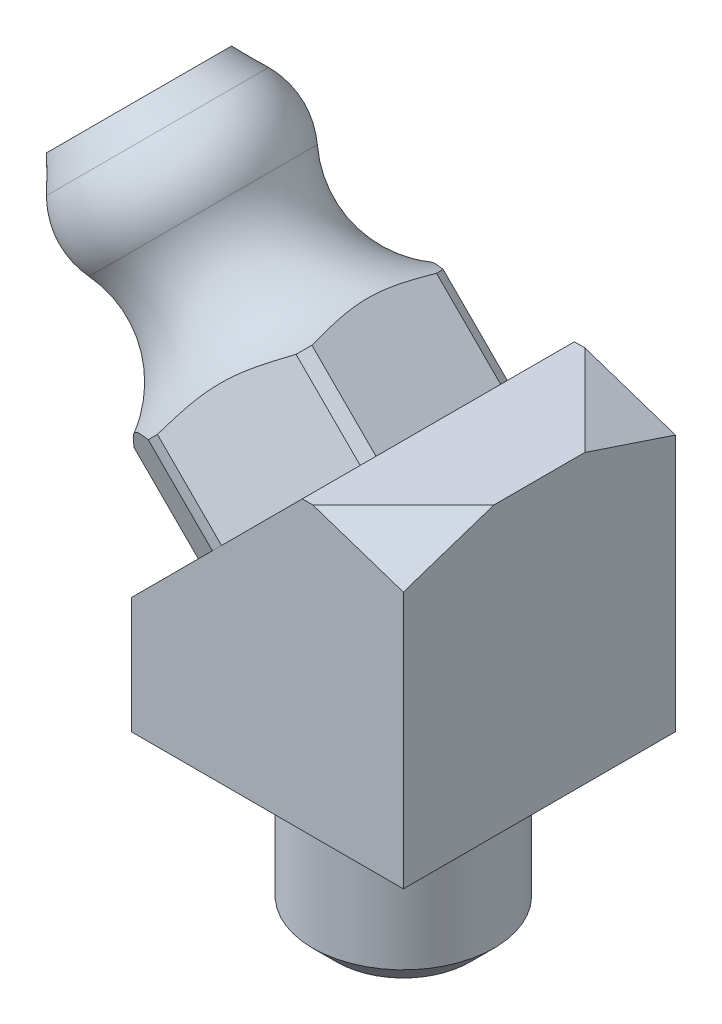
ISO-10303-21;
HEADER;
FILE_DESCRIPTION(('STEP AP214'),'2;1');
FILE_NAME('part.step','',(''),(''),'','','');
FILE_SCHEMA(('AUTOMOTIVE_DESIGN { 1 0 10303 214 1 1 1 1 }'));
ENDSEC;
DATA;
#1=APPLICATION_CONTEXT('core data for automotive mechanical design processes');
#2=APPLICATION_PROTOCOL_DEFINITION('international standard','automotive_design',2000,#1);
#3=PRODUCT_CONTEXT('',#1,'mechanical');
#4=PRODUCT('Part','Part','',(#3));
#5=PRODUCT_RELATED_PRODUCT_CATEGORY('part','',(#4));
#6=PRODUCT_DEFINITION_FORMATION('','',#4);
#7=PRODUCT_DEFINITION_CONTEXT('part definition',#1,'design');
#8=PRODUCT_DEFINITION('design','',#6,#7);
#9=PRODUCT_DEFINITION_SHAPE('','',#8);
#10=(LENGTH_UNIT() NAMED_UNIT(*) SI_UNIT(.MILLI.,.METRE.));
#11=(NAMED_UNIT(*) PLANE_ANGLE_UNIT() SI_UNIT($,.RADIAN.));
#12=(NAMED_UNIT(*) SI_UNIT($,.STERADIAN.) SOLID_ANGLE_UNIT());
#13=UNCERTAINTY_MEASURE_WITH_UNIT(LENGTH_MEASURE(1.E-05),#10,'distance_accuracy_value','');
#14=(GEOMETRIC_REPRESENTATION_CONTEXT(3) GLOBAL_UNCERTAINTY_ASSIGNED_CONTEXT((#13)) GLOBAL_UNIT_ASSIGNED_CONTEXT((#10,
#11,#12)) REPRESENTATION_CONTEXT('',''));
#15=CARTESIAN_POINT('',(0.,0.,0.));
#16=DIRECTION('',(0.,0.,1.));
#17=DIRECTION('',(1.,0.,0.));
#18=AXIS2_PLACEMENT_3D('',#15,#16,#17);
#19=CARTESIAN_POINT('',(-4.5,0.,4.5));
#20=DIRECTION('',(0.,0.,-1.));
#21=DIRECTION('',(-1.,0.,0.));
#22=AXIS2_PLACEMENT_3D('',#19,#20,#21);
#23=PLANE('',#22);
#24=DIRECTION('',(0.,-1.,0.));
#25=VECTOR('',#24,1.);
#26=CARTESIAN_POINT('',(4.5,9.5,4.5));
#27=LINE('',#26,#25);
#28=CARTESIAN_POINT('',(4.5,8.5,4.5));
#29=VERTEX_POINT('',#28);
#30=CARTESIAN_POINT('',(4.5,0.,4.5));
#31=VERTEX_POINT('',#30);
#32=EDGE_CURVE('E172',#29,#31,#27,.T.);
#33=ORIENTED_EDGE('',*,*,#32,.F.);
#34=DIRECTION('',(-0.948683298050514,0.316227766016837,0.));
#35=VECTOR('',#34,1.);
#36=CARTESIAN_POINT('',(-1.05000000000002,10.35,4.5));
#37=LINE('',#36,#35);
#38=CARTESIAN_POINT('',(1.49999999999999,9.5,4.5));
#39=VERTEX_POINT('',#38);
#40=EDGE_CURVE('E11',#29,#39,#37,.T.);
#41=ORIENTED_EDGE('',*,*,#40,.T.);
#42=DIRECTION('',(-1.,0.,0.));
#43=VECTOR('',#42,1.);
#44=CARTESIAN_POINT('',(4.5,9.5,4.5));
#45=LINE('',#44,#43);
#46=CARTESIAN_POINT('',(1.15685424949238,9.5,4.5));
#47=VERTEX_POINT('',#46);
#48=EDGE_CURVE('E178',#39,#47,#45,.T.);
#49=ORIENTED_EDGE('',*,*,#48,.T.);
#50=DIRECTION('',(0.707106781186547,0.707106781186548,0.));
#51=VECTOR('',#50,1.);
#52=CARTESIAN_POINT('',(-4.5,3.84314575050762,4.5));
#53=LINE('',#52,#51);
#54=CARTESIAN_POINT('',(-1.67157287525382,6.67157287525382,4.5));
#55=VERTEX_POINT('',#54);
#56=EDGE_CURVE('E240',#55,#47,#53,.T.);
#57=ORIENTED_EDGE('',*,*,#56,.F.);
#58=CARTESIAN_POINT('',(-4.5,3.84314575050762,4.5));
#59=VERTEX_POINT('',#58);
#60=EDGE_CURVE('E182',#59,#55,#53,.T.);
#61=ORIENTED_EDGE('',*,*,#60,.F.);
#62=DIRECTION('',(0.,1.,0.));
#63=VECTOR('',#62,1.);
#64=CARTESIAN_POINT('',(-4.5,0.,4.5));
#65=LINE('',#64,#63);
#66=CARTESIAN_POINT('',(-4.5,0.,4.5));
#67=VERTEX_POINT('',#66);
#68=EDGE_CURVE('E248',#67,#59,#65,.T.);
#69=ORIENTED_EDGE('',*,*,#68,.F.);
#70=DIRECTION('',(1.,0.,0.));
#71=VECTOR('',#70,1.);
#72=CARTESIAN_POINT('',(-4.5,0.,4.5));
#73=LINE('',#72,#71);
#74=EDGE_CURVE('E176',#67,#31,#73,.T.);
#75=ORIENTED_EDGE('',*,*,#74,.T.);
#76=EDGE_LOOP('',(#33,#41,#49,#57,#61,#69,#75));
#77=FACE_BOUND('',#76,.T.);
#78=ADVANCED_FACE('F30',(#77),#23,.F.);
#79=CARTESIAN_POINT('',(4.5,9.5,4.5));
#80=DIRECTION('',(0.,-1.,0.));
#81=DIRECTION('',(1.,0.,0.));
#82=AXIS2_PLACEMENT_3D('',#79,#80,#81);
#83=PLANE('',#82);
#84=ORIENTED_EDGE('',*,*,#48,.F.);
#85=DIRECTION('',(0.707106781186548,0.,-0.707106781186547));
#86=VECTOR('',#85,1.);
#87=CARTESIAN_POINT('',(3.,9.5,3.));
#88=LINE('',#87,#86);
#89=CARTESIAN_POINT('',(4.5,9.5,1.5));
#90=VERTEX_POINT('',#89);
#91=EDGE_CURVE('E45',#39,#90,#88,.T.);
#92=ORIENTED_EDGE('',*,*,#91,.T.);
#93=DIRECTION('',(0.,0.,-1.));
#94=VECTOR('',#93,1.);
#95=CARTESIAN_POINT('',(4.5,9.5,4.5));
#96=LINE('',#95,#94);
#97=CARTESIAN_POINT('',(4.5,9.5,-1.5));
#98=VERTEX_POINT('',#97);
#99=EDGE_CURVE('E51',#90,#98,#96,.T.);
#100=ORIENTED_EDGE('',*,*,#99,.T.);
#101=DIRECTION('',(-0.707106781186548,0.,-0.707106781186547));
#102=VECTOR('',#101,1.);
#103=CARTESIAN_POINT('',(7.5,9.5,1.5));
#104=LINE('',#103,#102);
#105=CARTESIAN_POINT('',(1.5,9.5,-4.5));
#106=VERTEX_POINT('',#105);
#107=EDGE_CURVE('E229',#98,#106,#104,.T.);
#108=ORIENTED_EDGE('',*,*,#107,.T.);
#109=DIRECTION('',(-1.,0.,0.));
#110=VECTOR('',#109,1.);
#111=CARTESIAN_POINT('',(4.5,9.5,-4.5));
#112=LINE('',#111,#110);
#113=CARTESIAN_POINT('',(1.15685424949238,9.5,-4.5));
#114=VERTEX_POINT('',#113);
#115=EDGE_CURVE('E257',#106,#114,#112,.T.);
#116=ORIENTED_EDGE('',*,*,#115,.T.);
#117=DIRECTION('',(0.,0.,-1.));
#118=VECTOR('',#117,1.);
#119=CARTESIAN_POINT('',(1.15685424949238,9.5,4.5));
#120=LINE('',#119,#118);
#121=CARTESIAN_POINT('',(1.15685424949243,9.50000000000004,-2.06155281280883));
#122=VERTEX_POINT('',#121);
#123=EDGE_CURVE('E195',#122,#114,#120,.T.);
#124=ORIENTED_EDGE('',*,*,#123,.F.);
#125=CARTESIAN_POINT('',(1.15685424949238,9.5,2.06155281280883));
#126=VERTEX_POINT('',#125);
#127=EDGE_CURVE('E194',#126,#122,#120,.T.);
#128=ORIENTED_EDGE('',*,*,#127,.F.);
#129=EDGE_CURVE('E192',#47,#126,#120,.T.);
#130=ORIENTED_EDGE('',*,*,#129,.F.);
#131=EDGE_LOOP('',(#84,#92,#100,#108,#116,#124,#128,#130));
#132=FACE_BOUND('',#131,.T.);
#133=ADVANCED_FACE('F234',(#132),#83,.F.);
#134=CARTESIAN_POINT('',(-5.70769747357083,10.7076974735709,0.));
#135=DIRECTION('',(-0.707106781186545,0.70710678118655,0.));
#136=DIRECTION('',(-0.70710678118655,-0.707106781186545,0.));
#137=AXIS2_PLACEMENT_3D('',#134,#135,#136);
#138=TOROIDAL_SURFACE('',#137,5.79114264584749,3.);
#139=CARTESIAN_POINT('',(-6.62132034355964,11.6213203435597,0.));
#140=DIRECTION('',(-0.707106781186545,0.70710678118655,0.));
#141=DIRECTION('',(-0.70710678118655,-0.707106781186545,0.));
#142=AXIS2_PLACEMENT_3D('',#139,#140,#141);
#143=CIRCLE('',#142,3.08363705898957);
#144=CARTESIAN_POINT('',(-8.80178101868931,9.44085966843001,0.));
#145=VERTEX_POINT('',#144);
#146=EDGE_CURVE('E271',#145,#145,#143,.T.);
#147=ORIENTED_EDGE('',*,*,#146,.F.);
#148=EDGE_LOOP('',(#147));
#149=FACE_BOUND('',#148,.T.);
#150=CARTESIAN_POINT('',(-3.79289321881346,8.79289321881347,0.));
#151=DIRECTION('',(-0.707106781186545,0.70710678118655,0.));
#152=DIRECTION('',(-0.70710678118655,-0.707106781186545,0.));
#153=AXIS2_PLACEMENT_3D('',#150,#151,#152);
#154=CIRCLE('',#153,4.5);
#155=CARTESIAN_POINT('',(-6.62132034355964,5.96446609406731,2.06155281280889));
#156=VERTEX_POINT('',#155);
#157=CARTESIAN_POINT('',(-6.46954489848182,6.11624153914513,2.43332520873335));
#158=VERTEX_POINT('',#157);
#159=EDGE_CURVE('E274',#156,#158,#154,.T.);
#160=ORIENTED_EDGE('',*,*,#159,.T.);
#161=CARTESIAN_POINT('',(-6.58366799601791,5.92632384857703,2.30920107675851));
#162=CARTESIAN_POINT('',(-6.52491432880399,6.02314401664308,2.37271382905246));
#163=CARTESIAN_POINT('',(-6.46696755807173,6.12051787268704,2.43612320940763));
#164=CARTESIAN_POINT('',(-6.35085272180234,6.31525555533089,2.56302821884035));
#165=CARTESIAN_POINT('',(-6.29268448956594,6.41261926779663,2.62652386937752));
#166=CARTESIAN_POINT('',(-6.17398746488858,6.60669802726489,2.75421404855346));
#167=CARTESIAN_POINT('',(-6.11344488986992,6.70340362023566,2.81841034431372));
#168=CARTESIAN_POINT('',(-5.98845520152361,6.8939495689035,2.94722722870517));
#169=CARTESIAN_POINT('',(-5.92400940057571,6.98779087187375,3.01184766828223));
#170=CARTESIAN_POINT('',(-5.79129113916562,7.16853006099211,3.13981613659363));
#171=CARTESIAN_POINT('',(-5.72317056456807,7.25554741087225,3.20315092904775));
#172=CARTESIAN_POINT('',(-5.5805613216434,7.42397161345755,3.33012980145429));
#173=CARTESIAN_POINT('',(-5.50607356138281,7.50537926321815,3.3937738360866));
#174=CARTESIAN_POINT('',(-5.35091159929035,7.66143445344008,3.52082770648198));
#175=CARTESIAN_POINT('',(-5.27026240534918,7.73610689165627,3.58423749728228));
#176=CARTESIAN_POINT('',(-5.103312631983,7.87909242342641,3.71076805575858));
#177=CARTESIAN_POINT('',(-5.01701135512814,7.94740472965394,3.77388878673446));
#178=CARTESIAN_POINT('',(-4.85057169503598,8.07086047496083,3.89223809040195));
#179=CARTESIAN_POINT('',(-4.77091027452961,8.12660613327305,3.94751779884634));
#180=CARTESIAN_POINT('',(-4.60915970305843,8.23500613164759,4.05780630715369));
#181=CARTESIAN_POINT('',(-4.52706765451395,8.28765653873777,4.11281468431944));
#182=CARTESIAN_POINT('',(-4.36040096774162,8.39168714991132,4.22332639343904));
#183=CARTESIAN_POINT('',(-4.2758077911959,8.44304076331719,4.27882643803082));
#184=CARTESIAN_POINT('',(-4.10625795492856,8.54485298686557,4.38960953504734));
#185=CARTESIAN_POINT('',(-4.0213024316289,8.59531325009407,4.44489279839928));
#186=CARTESIAN_POINT('',(-3.93650705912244,8.64599230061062,4.5002));
#187=B_SPLINE_CURVE_WITH_KNOTS('',3,(#161,#162,#163,#164,#165,#166,#167,#168,#169,#170,#171,
#172,#173,#174,#175,#176,#177,#178,#179,#180,#181,#182,#183,#184,#185,#186),.UNSPECIFIED.,.F.,
.F.,(4,2,2,2,2,2,2,2,2,2,2,2,4),(0.,0.389537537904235,0.779477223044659,1.17217402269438,
1.56473951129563,1.94662073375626,2.32844758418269,2.70879954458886,3.08919852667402,
3.42464287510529,3.76050463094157,4.10088145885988,4.44054347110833),.UNSPECIFIED.);
#188=CARTESIAN_POINT('',(-3.94466866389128,8.64111777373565,4.49487802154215));
#189=VERTEX_POINT('',#188);
#190=EDGE_CURVE('E284',#158,#189,#187,.T.);
#191=ORIENTED_EDGE('',*,*,#190,.T.);
#192=CARTESIAN_POINT('',(-3.64111777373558,8.94466866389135,4.49487802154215));
#193=VERTEX_POINT('',#192);
#194=EDGE_CURVE('E277',#189,#193,#154,.T.);
#195=ORIENTED_EDGE('',*,*,#194,.T.);
#196=CARTESIAN_POINT('',(-0.926323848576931,11.5836679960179,2.30920107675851));
#197=CARTESIAN_POINT('',(-1.02314401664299,11.524914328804,2.37271382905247));
#198=CARTESIAN_POINT('',(-1.12051787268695,11.4669675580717,2.43612320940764));
#199=CARTESIAN_POINT('',(-1.31525555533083,11.3508527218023,2.56302821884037));
#200=CARTESIAN_POINT('',(-1.41261926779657,11.2926844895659,2.62652386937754));
#201=CARTESIAN_POINT('',(-1.60669802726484,11.1739874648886,2.75421404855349));
#202=CARTESIAN_POINT('',(-1.70340362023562,11.1134448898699,2.81841034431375));
#203=CARTESIAN_POINT('',(-1.89394956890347,10.9884552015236,2.94722722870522));
#204=CARTESIAN_POINT('',(-1.98779087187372,10.9240094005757,3.01184766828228));
#205=CARTESIAN_POINT('',(-2.1685300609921,10.7912911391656,3.13981613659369));
#206=CARTESIAN_POINT('',(-2.25554741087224,10.723170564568,3.20315092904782));
#207=CARTESIAN_POINT('',(-2.42397161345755,10.5805613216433,3.33012980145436));
#208=CARTESIAN_POINT('',(-2.50537926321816,10.5060735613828,3.39377383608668));
#209=CARTESIAN_POINT('',(-2.66143445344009,10.3509115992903,3.52082770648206));
#210=CARTESIAN_POINT('',(-2.73610689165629,10.2702624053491,3.58423749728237));
#211=CARTESIAN_POINT('',(-2.87909242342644,10.1033126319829,3.71076805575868));
#212=CARTESIAN_POINT('',(-2.94740472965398,10.017011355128,3.77388878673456));
#213=CARTESIAN_POINT('',(-3.07086047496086,9.85057169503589,3.89223809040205));
#214=CARTESIAN_POINT('',(-3.12660613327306,9.77091027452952,3.94751779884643));
#215=CARTESIAN_POINT('',(-3.23500613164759,9.60915970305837,4.05780630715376));
#216=CARTESIAN_POINT('',(-3.28765653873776,9.52706765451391,4.11281468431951));
#217=CARTESIAN_POINT('',(-3.39168714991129,9.3604009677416,4.22332639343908));
#218=CARTESIAN_POINT('',(-3.44304076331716,9.27580779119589,4.27882643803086));
#219=CARTESIAN_POINT('',(-3.54485298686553,9.10625795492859,4.38960953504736));
#220=CARTESIAN_POINT('',(-3.59531325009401,9.02130243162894,4.44489279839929));
#221=CARTESIAN_POINT('',(-3.64599230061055,8.9365070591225,4.5002));
#222=B_SPLINE_CURVE_WITH_KNOTS('',3,(#196,#197,#198,#199,#200,#201,#202,#203,#204,#205,#206,
#207,#208,#209,#210,#211,#212,#213,#214,#215,#216,#217,#218,#219,#220,#221),.UNSPECIFIED.,.F.,
.F.,(4,2,2,2,2,2,2,2,2,2,2,2,4),(0.,0.389537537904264,0.779477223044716,1.17217402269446,
1.56473951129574,1.9466207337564,2.32844758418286,2.70879954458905,3.08919852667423,
3.42464287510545,3.76050463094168,4.10088145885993,4.44054347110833),.UNSPECIFIED.);
#223=CARTESIAN_POINT('',(-1.1162415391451,11.4695448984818,2.43332520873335));
#224=VERTEX_POINT('',#223);
#225=EDGE_CURVE('E292',#224,#193,#222,.T.);
#226=ORIENTED_EDGE('',*,*,#225,.F.);
#227=CARTESIAN_POINT('',(-0.964466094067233,11.6213203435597,2.06155281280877));
#228=VERTEX_POINT('',#227);
#229=EDGE_CURVE('E468',#224,#228,#154,.T.);
#230=ORIENTED_EDGE('',*,*,#229,.T.);
#231=CARTESIAN_POINT('',(-0.926598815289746,11.5834530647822,-2.30960107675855));
#232=CARTESIAN_POINT('',(-0.945621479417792,11.6024757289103,-2.18265112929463));
#233=CARTESIAN_POINT('',(-0.965323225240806,11.6221774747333,-2.05590756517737));
#234=CARTESIAN_POINT('',(-1.00461118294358,11.661465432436,-1.80224897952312));
#235=CARTESIAN_POINT('',(-1.02419725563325,11.6810515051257,-1.67533391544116));
#236=CARTESIAN_POINT('',(-1.06186574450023,11.7187199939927,-1.42012094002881));
#237=CARTESIAN_POINT('',(-1.07993673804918,11.7367909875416,-1.29181955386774));
#238=CARTESIAN_POINT('',(-1.11270108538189,11.7695553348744,-1.03436921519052));
#239=CARTESIAN_POINT('',(-1.12739554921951,11.784249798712,-0.905220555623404));
#240=CARTESIAN_POINT('',(-1.15142339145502,11.8082776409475,-0.649320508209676));
#241=CARTESIAN_POINT('',(-1.16088663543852,11.817740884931,-0.522594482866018));
#242=CARTESIAN_POINT('',(-1.17381979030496,11.8306740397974,-0.268523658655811));
#243=CARTESIAN_POINT('',(-1.17729060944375,11.8341448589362,-0.141178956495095));
#244=CARTESIAN_POINT('',(-1.17775286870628,11.8346071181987,0.113035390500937));
#245=CARTESIAN_POINT('',(-1.1747696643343,11.8316239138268,0.239904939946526));
#246=CARTESIAN_POINT('',(-1.16279313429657,11.819647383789,0.493068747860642));
#247=CARTESIAN_POINT('',(-1.15379889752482,11.8106531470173,0.619362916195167));
#248=CARTESIAN_POINT('',(-1.13050880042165,11.7873630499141,0.87589246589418));
#249=CARTESIAN_POINT('',(-1.11602163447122,11.7728758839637,1.00609172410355));
#250=CARTESIAN_POINT('',(-1.08347703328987,11.7403312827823,1.26578122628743));
#251=CARTESIAN_POINT('',(-1.06541377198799,11.7222680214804,1.39526995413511));
#252=CARTESIAN_POINT('',(-1.02719155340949,11.6840458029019,1.65573994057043));
#253=CARTESIAN_POINT('',(-1.00700406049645,11.6638583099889,1.78671256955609));
#254=CARTESIAN_POINT('',(-0.976627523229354,11.6334817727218,1.9829566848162));
#255=CARTESIAN_POINT('',(-0.966499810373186,11.6233540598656,2.0482479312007));
#256=CARTESIAN_POINT('',(-0.946391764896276,11.6032460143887,2.17887588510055));
#257=CARTESIAN_POINT('',(-0.936411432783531,11.593265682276,2.24421259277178));
#258=CARTESIAN_POINT('',(-0.926598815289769,11.5834530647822,2.30960107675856));
#259=B_SPLINE_CURVE_WITH_KNOTS('',3,(#231,#232,#233,#234,#235,#236,#237,#238,#239,#240,#241,
#242,#243,#244,#245,#246,#247,#248,#249,#250,#251,#252,#253,#254,#255,#256,#257,#258),
.UNSPECIFIED.,.F.,.F.,(4,2,2,2,2,2,2,2,2,2,2,2,2,4),(0.,0.389306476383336,0.779012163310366,
1.1714320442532,1.56372272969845,1.94577878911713,2.32777693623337,2.70827707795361,
3.08883490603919,3.48408755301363,3.8799895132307,4.28212932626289,4.48266064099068,
4.68319264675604),.UNSPECIFIED.);
#260=CARTESIAN_POINT('',(-0.964466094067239,11.6213203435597,-2.06155281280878));
#261=VERTEX_POINT('',#260);
#262=EDGE_CURVE('E420',#261,#228,#259,.T.);
#263=ORIENTED_EDGE('',*,*,#262,.F.);
#264=CARTESIAN_POINT('',(-1.11624153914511,11.4695448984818,-2.43332520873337));
#265=VERTEX_POINT('',#264);
#266=EDGE_CURVE('E469',#261,#265,#154,.T.);
#267=ORIENTED_EDGE('',*,*,#266,.T.);
#268=CARTESIAN_POINT('',(-0.926323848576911,11.5836679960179,-2.30920107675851));
#269=CARTESIAN_POINT('',(-1.02314401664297,11.524914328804,-2.37271382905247));
#270=CARTESIAN_POINT('',(-1.12051787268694,11.4669675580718,-2.43612320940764));
#271=CARTESIAN_POINT('',(-1.31525555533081,11.3508527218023,-2.56302821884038));
#272=CARTESIAN_POINT('',(-1.41261926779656,11.2926844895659,-2.62652386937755));
#273=CARTESIAN_POINT('',(-1.60669802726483,11.1739874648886,-2.7542140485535));
#274=CARTESIAN_POINT('',(-1.70340362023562,11.1134448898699,-2.81841034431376));
#275=CARTESIAN_POINT('',(-1.89394956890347,10.9884552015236,-2.94722722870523));
#276=CARTESIAN_POINT('',(-1.98779087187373,10.9240094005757,-3.01184766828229));
#277=CARTESIAN_POINT('',(-2.16853006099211,10.7912911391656,-3.13981613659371));
#278=CARTESIAN_POINT('',(-2.25554741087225,10.723170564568,-3.20315092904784));
#279=CARTESIAN_POINT('',(-2.42397161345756,10.5805613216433,-3.33012980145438));
#280=CARTESIAN_POINT('',(-2.50537926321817,10.5060735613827,-3.3937738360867));
#281=CARTESIAN_POINT('',(-2.66143445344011,10.3509115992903,-3.52082770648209));
#282=CARTESIAN_POINT('',(-2.73610689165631,10.2702624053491,-3.5842374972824));
#283=CARTESIAN_POINT('',(-2.87909242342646,10.1033126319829,-3.71076805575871));
#284=CARTESIAN_POINT('',(-2.947404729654,10.017011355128,-3.7738887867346));
#285=CARTESIAN_POINT('',(-3.07086047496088,9.85057169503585,-3.89223809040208));
#286=CARTESIAN_POINT('',(-3.12660613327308,9.77091027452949,-3.94751779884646));
#287=CARTESIAN_POINT('',(-3.23500613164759,9.60915970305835,-4.05780630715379));
#288=CARTESIAN_POINT('',(-3.28765653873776,9.52706765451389,-4.11281468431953));
#289=CARTESIAN_POINT('',(-3.39168714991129,9.36040096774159,-4.2233263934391));
#290=CARTESIAN_POINT('',(-3.44304076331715,9.27580779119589,-4.27882643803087));
#291=CARTESIAN_POINT('',(-3.54485298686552,9.10625795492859,-4.38960953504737));
#292=CARTESIAN_POINT('',(-3.595313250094,9.02130243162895,-4.44489279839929));
#293=CARTESIAN_POINT('',(-3.64599230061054,8.93650705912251,-4.5002));
#294=B_SPLINE_CURVE_WITH_KNOTS('',3,(#268,#269,#270,#271,#272,#273,#274,#275,#276,#277,#278,
#279,#280,#281,#282,#283,#284,#285,#286,#287,#288,#289,#290,#291,#292,#293),.UNSPECIFIED.,.F.,
.F.,(4,2,2,2,2,2,2,2,2,2,2,2,4),(0.,0.389537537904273,0.779477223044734,1.17217402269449,
1.56473951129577,1.94662073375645,2.32844758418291,2.70879954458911,3.08919852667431,
3.42464287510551,3.76050463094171,4.10088145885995,4.44054347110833),.UNSPECIFIED.);
#295=CARTESIAN_POINT('',(-3.64111777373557,8.94466866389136,-4.49487802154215));
#296=VERTEX_POINT('',#295);
#297=EDGE_CURVE('E441',#265,#296,#294,.T.);
#298=ORIENTED_EDGE('',*,*,#297,.T.);
#299=CARTESIAN_POINT('',(-3.94466866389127,8.64111777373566,-4.49487802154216));
#300=VERTEX_POINT('',#299);
#301=EDGE_CURVE('E470',#296,#300,#154,.T.);
#302=ORIENTED_EDGE('',*,*,#301,.T.);
#303=CARTESIAN_POINT('',(-6.58366799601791,5.92632384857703,-2.30920107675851));
#304=CARTESIAN_POINT('',(-6.52491432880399,6.02314401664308,-2.37271382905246));
#305=CARTESIAN_POINT('',(-6.46696755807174,6.12051787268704,-2.43612320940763));
#306=CARTESIAN_POINT('',(-6.35085272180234,6.3152555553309,-2.56302821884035));
#307=CARTESIAN_POINT('',(-6.29268448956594,6.41261926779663,-2.62652386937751));
#308=CARTESIAN_POINT('',(-6.17398746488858,6.60669802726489,-2.75421404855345));
#309=CARTESIAN_POINT('',(-6.11344488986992,6.70340362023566,-2.81841034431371));
#310=CARTESIAN_POINT('',(-5.98845520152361,6.8939495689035,-2.94722722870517));
#311=CARTESIAN_POINT('',(-5.92400940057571,6.98779087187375,-3.01184766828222));
#312=CARTESIAN_POINT('',(-5.79129113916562,7.16853006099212,-3.13981613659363));
#313=CARTESIAN_POINT('',(-5.72317056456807,7.25554741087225,-3.20315092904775));
#314=CARTESIAN_POINT('',(-5.5805613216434,7.42397161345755,-3.33012980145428));
#315=CARTESIAN_POINT('',(-5.50607356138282,7.50537926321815,-3.39377383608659));
#316=CARTESIAN_POINT('',(-5.35091159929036,7.66143445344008,-3.52082770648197));
#317=CARTESIAN_POINT('',(-5.27026240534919,7.73610689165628,-3.58423749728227));
#318=CARTESIAN_POINT('',(-5.103312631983,7.87909242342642,-3.71076805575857));
#319=CARTESIAN_POINT('',(-5.01701135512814,7.94740472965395,-3.77388878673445));
#320=CARTESIAN_POINT('',(-4.85057169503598,8.07086047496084,-3.89223809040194));
#321=CARTESIAN_POINT('',(-4.77091027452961,8.12660613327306,-3.94751779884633));
#322=CARTESIAN_POINT('',(-4.60915970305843,8.2350061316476,-4.05780630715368));
#323=CARTESIAN_POINT('',(-4.52706765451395,8.28765653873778,-4.11281468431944));
#324=CARTESIAN_POINT('',(-4.36040096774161,8.39168714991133,-4.22332639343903));
#325=CARTESIAN_POINT('',(-4.27580779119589,8.4430407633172,-4.27882643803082));
#326=CARTESIAN_POINT('',(-4.10625795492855,8.54485298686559,-4.38960953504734));
#327=CARTESIAN_POINT('',(-4.02130243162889,8.59531325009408,-4.44489279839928));
#328=CARTESIAN_POINT('',(-3.93650705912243,8.64599230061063,-4.5002));
#329=B_SPLINE_CURVE_WITH_KNOTS('',3,(#303,#304,#305,#306,#307,#308,#309,#310,#311,#312,#313,
#314,#315,#316,#317,#318,#319,#320,#321,#322,#323,#324,#325,#326,#327,#328),.UNSPECIFIED.,.F.,
.F.,(4,2,2,2,2,2,2,2,2,2,2,2,4),(0.,0.389537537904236,0.77947722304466,1.17217402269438,
1.56473951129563,1.94662073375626,2.32844758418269,2.70879954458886,3.08919852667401,
3.42464287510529,3.76050463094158,4.10088145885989,4.44054347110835),.UNSPECIFIED.);
#330=CARTESIAN_POINT('',(-6.46954489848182,6.11624153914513,-2.43332520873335));
#331=VERTEX_POINT('',#330);
#332=EDGE_CURVE('E447',#331,#300,#329,.T.);
#333=ORIENTED_EDGE('',*,*,#332,.F.);
#334=CARTESIAN_POINT('',(-6.62132034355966,5.96446609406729,-2.06155281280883));
#335=VERTEX_POINT('',#334);
#336=EDGE_CURVE('E278',#331,#335,#154,.T.);
#337=ORIENTED_EDGE('',*,*,#336,.T.);
#338=CARTESIAN_POINT('',(-6.58345306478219,5.92659881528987,-2.30960107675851));
#339=CARTESIAN_POINT('',(-6.60247572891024,5.94562147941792,-2.1826511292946));
#340=CARTESIAN_POINT('',(-6.62217747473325,5.96532322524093,-2.05590756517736));
#341=CARTESIAN_POINT('',(-6.66146543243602,6.0046111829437,-1.80224897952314));
#342=CARTESIAN_POINT('',(-6.68105150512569,6.02419725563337,-1.6753339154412));
#343=CARTESIAN_POINT('',(-6.71871999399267,6.06186574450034,-1.42012094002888));
#344=CARTESIAN_POINT('',(-6.73679098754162,6.0799367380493,-1.29181955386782));
#345=CARTESIAN_POINT('',(-6.76955533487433,6.112701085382,-1.03436921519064));
#346=CARTESIAN_POINT('',(-6.78424979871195,6.12739554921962,-0.905220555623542));
#347=CARTESIAN_POINT('',(-6.80827764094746,6.15142339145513,-0.649320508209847));
#348=CARTESIAN_POINT('',(-6.81774088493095,6.16088663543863,-0.522594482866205));
#349=CARTESIAN_POINT('',(-6.8306740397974,6.17381979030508,-0.268523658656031));
#350=CARTESIAN_POINT('',(-6.83414485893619,6.17729060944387,-0.141178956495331));
#351=CARTESIAN_POINT('',(-6.83460711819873,6.17775286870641,0.113035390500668));
#352=CARTESIAN_POINT('',(-6.83162391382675,6.17476966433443,0.239904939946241));
#353=CARTESIAN_POINT('',(-6.81964738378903,6.16279313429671,0.493068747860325));
#354=CARTESIAN_POINT('',(-6.81065314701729,6.15379889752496,0.619362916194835));
#355=CARTESIAN_POINT('',(-6.78736304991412,6.13050880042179,0.875892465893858));
#356=CARTESIAN_POINT('',(-6.77287588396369,6.11602163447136,1.00609172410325));
#357=CARTESIAN_POINT('',(-6.74033128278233,6.08347703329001,1.26578122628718));
#358=CARTESIAN_POINT('',(-6.72226802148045,6.06541377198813,1.39526995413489));
#359=CARTESIAN_POINT('',(-6.68404580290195,6.02719155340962,1.65573994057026));
#360=CARTESIAN_POINT('',(-6.6638583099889,6.00700406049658,1.78671256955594));
#361=CARTESIAN_POINT('',(-6.63348177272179,5.97662752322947,1.9829566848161));
#362=CARTESIAN_POINT('',(-6.62335405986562,5.9664998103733,2.04824793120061));
#363=CARTESIAN_POINT('',(-6.60324601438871,5.94639176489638,2.17887588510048));
#364=CARTESIAN_POINT('',(-6.59326568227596,5.93641143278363,2.24421259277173));
#365=CARTESIAN_POINT('',(-6.58345306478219,5.92659881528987,2.30960107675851));
#366=B_SPLINE_CURVE_WITH_KNOTS('',3,(#338,#339,#340,#341,#342,#343,#344,#345,#346,#347,#348,
#349,#350,#351,#352,#353,#354,#355,#356,#357,#358,#359,#360,#361,#362,#363,#364,#365),
.UNSPECIFIED.,.F.,.F.,(4,2,2,2,2,2,2,2,2,2,2,2,2,4),(0.,0.389306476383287,0.779012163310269,
1.17143204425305,1.56372272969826,1.94577878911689,2.32777693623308,2.70827707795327,
3.0888349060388,3.48408755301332,3.87998951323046,4.28212932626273,4.48266064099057,
4.68319264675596),.UNSPECIFIED.);
#367=EDGE_CURVE('E451',#335,#156,#366,.T.);
#368=ORIENTED_EDGE('',*,*,#367,.T.);
#369=EDGE_LOOP('',(#160,#191,#195,#226,#230,#263,#267,#298,#302,#333,#337,#368));
#370=FACE_BOUND('',#369,.T.);
#371=ADVANCED_FACE('F298',(#149,#370),#138,.F.);
#372=CARTESIAN_POINT('',(-9.77263204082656,14.7726320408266,0.));
#373=DIRECTION('',(-0.707106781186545,0.70710678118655,0.));
#374=DIRECTION('',(-0.70710678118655,-0.707106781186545,0.));
#375=AXIS2_PLACEMENT_3D('',#372,#373,#374);
#376=CYLINDRICAL_SURFACE('',#375,4.5);
#377=ORIENTED_EDGE('',*,*,#194,.F.);
#378=DIRECTION('',(-0.707106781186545,0.70710678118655,0.));
#379=VECTOR('',#378,1.);
#380=CARTESIAN_POINT('',(-9.92440748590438,14.6208565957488,4.49487802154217));
#381=LINE('',#380,#379);
#382=CARTESIAN_POINT('',(-1.82334832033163,6.51979743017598,4.49487802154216));
#383=VERTEX_POINT('',#382);
#384=EDGE_CURVE('E223',#189,#383,#381,.F.);
#385=ORIENTED_EDGE('',*,*,#384,.T.);
#386=CARTESIAN_POINT('',(-1.67157287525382,6.67157287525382,0.));
#387=DIRECTION('',(-0.707106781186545,0.70710678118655,0.));
#388=DIRECTION('',(-0.70710678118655,-0.707106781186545,0.));
#389=AXIS2_PLACEMENT_3D('',#386,#387,#388);
#390=CIRCLE('',#389,4.5);
#391=EDGE_CURVE('E282',#383,#55,#390,.T.);
#392=ORIENTED_EDGE('',*,*,#391,.T.);
#393=CARTESIAN_POINT('',(-1.51979743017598,6.82334832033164,4.49487802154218));
#394=VERTEX_POINT('',#393);
#395=EDGE_CURVE('E203',#55,#394,#390,.T.);
#396=ORIENTED_EDGE('',*,*,#395,.T.);
#397=DIRECTION('',(-0.707106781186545,0.70710678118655,0.));
#398=VECTOR('',#397,1.);
#399=CARTESIAN_POINT('',(-9.62085659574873,14.9244074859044,4.49487802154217));
#400=LINE('',#399,#398);
#401=EDGE_CURVE('E218',#193,#394,#400,.F.);
#402=ORIENTED_EDGE('',*,*,#401,.F.);
#403=EDGE_LOOP('',(#377,#385,#392,#396,#402));
#404=FACE_BOUND('',#403,.T.);
#405=ADVANCED_FACE('F312',(#404),#376,.T.);
#406=CARTESIAN_POINT('',(-4.49999999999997,3.84314575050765,2.06155281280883));
#407=VERTEX_POINT('',#406);
#408=CARTESIAN_POINT('',(-4.34822455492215,3.99492119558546,2.43332520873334));
#409=VERTEX_POINT('',#408);
#410=EDGE_CURVE('E279',#407,#409,#390,.T.);
#411=ORIENTED_EDGE('',*,*,#410,.T.);
#412=DIRECTION('',(-0.707106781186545,0.70710678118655,0.));
#413=VECTOR('',#412,1.);
#414=CARTESIAN_POINT('',(-12.4492837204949,12.0959803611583,2.43332520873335));
#415=LINE('',#414,#413);
#416=EDGE_CURVE('E220',#409,#158,#415,.T.);
#417=ORIENTED_EDGE('',*,*,#416,.T.);
#418=ORIENTED_EDGE('',*,*,#159,.F.);
#419=DIRECTION('',(-0.707106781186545,0.70710678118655,0.));
#420=VECTOR('',#419,1.);
#421=CARTESIAN_POINT('',(-12.6010591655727,11.9442049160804,2.06155281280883));
#422=LINE('',#421,#420);
#423=EDGE_CURVE('E202',#156,#407,#422,.F.);
#424=ORIENTED_EDGE('',*,*,#423,.T.);
#425=EDGE_LOOP('',(#411,#417,#418,#424));
#426=FACE_BOUND('',#425,.T.);
#427=ADVANCED_FACE('F314',(#426),#376,.T.);
#428=DIRECTION('',(-0.707106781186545,0.70710678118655,0.));
#429=VECTOR('',#428,1.);
#430=CARTESIAN_POINT('',(-7.0959803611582,17.449283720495,2.43332520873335));
#431=LINE('',#430,#429);
#432=CARTESIAN_POINT('',(1.00507880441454,9.34822455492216,2.43332520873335));
#433=VERTEX_POINT('',#432);
#434=EDGE_CURVE('E216',#433,#224,#431,.T.);
#435=ORIENTED_EDGE('',*,*,#434,.F.);
#436=EDGE_CURVE('E383',#433,#126,#390,.T.);
#437=ORIENTED_EDGE('',*,*,#436,.T.);
#438=DIRECTION('',(-0.707106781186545,0.70710678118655,0.));
#439=VECTOR('',#438,1.);
#440=CARTESIAN_POINT('',(-6.94420491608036,17.6010591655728,2.06155281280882));
#441=LINE('',#440,#439);
#442=EDGE_CURVE('E426',#228,#126,#441,.F.);
#443=ORIENTED_EDGE('',*,*,#442,.F.);
#444=ORIENTED_EDGE('',*,*,#229,.F.);
#445=EDGE_LOOP('',(#435,#437,#443,#444));
#446=FACE_BOUND('',#445,.T.);
#447=ADVANCED_FACE('F321',(#446),#376,.T.);
#448=ORIENTED_EDGE('',*,*,#301,.F.);
#449=DIRECTION('',(-0.707106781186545,0.70710678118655,0.));
#450=VECTOR('',#449,1.);
#451=CARTESIAN_POINT('',(-9.62085659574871,14.9244074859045,-4.49487802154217));
#452=LINE('',#451,#450);
#453=CARTESIAN_POINT('',(-1.51979743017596,6.82334832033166,-4.49487802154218));
#454=VERTEX_POINT('',#453);
#455=EDGE_CURVE('E213',#296,#454,#452,.F.);
#456=ORIENTED_EDGE('',*,*,#455,.T.);
#457=CARTESIAN_POINT('',(-1.67157287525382,6.67157287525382,-4.5));
#458=VERTEX_POINT('',#457);
#459=EDGE_CURVE('E373',#454,#458,#390,.T.);
#460=ORIENTED_EDGE('',*,*,#459,.T.);
#461=CARTESIAN_POINT('',(-1.82334832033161,6.519797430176,-4.49487802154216));
#462=VERTEX_POINT('',#461);
#463=EDGE_CURVE('E283',#458,#462,#390,.T.);
#464=ORIENTED_EDGE('',*,*,#463,.T.);
#465=DIRECTION('',(-0.707106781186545,0.70710678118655,0.));
#466=VECTOR('',#465,1.);
#467=CARTESIAN_POINT('',(-9.92440748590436,14.6208565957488,-4.49487802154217));
#468=LINE('',#467,#466);
#469=EDGE_CURVE('E208',#300,#462,#468,.F.);
#470=ORIENTED_EDGE('',*,*,#469,.F.);
#471=EDGE_LOOP('',(#448,#456,#460,#464,#470));
#472=FACE_BOUND('',#471,.T.);
#473=ADVANCED_FACE('F406',(#472),#376,.T.);
#474=DIRECTION('',(-0.707106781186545,0.70710678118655,0.));
#475=VECTOR('',#474,1.);
#476=CARTESIAN_POINT('',(-6.94420491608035,17.6010591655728,-2.06155281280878));
#477=LINE('',#476,#475);
#478=EDGE_CURVE('E382',#122,#261,#477,.T.);
#479=ORIENTED_EDGE('',*,*,#478,.F.);
#480=CARTESIAN_POINT('',(1.00507880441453,9.34822455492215,-2.43332520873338));
#481=VERTEX_POINT('',#480);
#482=EDGE_CURVE('E369',#122,#481,#390,.T.);
#483=ORIENTED_EDGE('',*,*,#482,.T.);
#484=DIRECTION('',(-0.707106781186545,0.70710678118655,0.));
#485=VECTOR('',#484,1.);
#486=CARTESIAN_POINT('',(-7.09598036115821,17.4492837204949,-2.43332520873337));
#487=LINE('',#486,#485);
#488=EDGE_CURVE('E210',#481,#265,#487,.T.);
#489=ORIENTED_EDGE('',*,*,#488,.T.);
#490=ORIENTED_EDGE('',*,*,#266,.F.);
#491=EDGE_LOOP('',(#479,#483,#489,#490));
#492=FACE_BOUND('',#491,.T.);
#493=ADVANCED_FACE('F327',(#492),#376,.T.);
#494=DIRECTION('',(-0.707106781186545,0.70710678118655,0.));
#495=VECTOR('',#494,1.);
#496=CARTESIAN_POINT('',(-12.4492837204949,12.0959803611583,-2.43332520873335));
#497=LINE('',#496,#495);
#498=CARTESIAN_POINT('',(-4.34822455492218,3.99492119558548,-2.43332520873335));
#499=VERTEX_POINT('',#498);
#500=EDGE_CURVE('E206',#499,#331,#497,.T.);
#501=ORIENTED_EDGE('',*,*,#500,.F.);
#502=CARTESIAN_POINT('',(-4.49999999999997,3.84314575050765,-2.06155281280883));
#503=VERTEX_POINT('',#502);
#504=EDGE_CURVE('E188',#499,#503,#390,.T.);
#505=ORIENTED_EDGE('',*,*,#504,.T.);
#506=DIRECTION('',(-0.707106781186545,0.70710678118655,0.));
#507=VECTOR('',#506,1.);
#508=CARTESIAN_POINT('',(-12.6010591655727,11.9442049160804,-2.06155281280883));
#509=LINE('',#508,#507);
#510=EDGE_CURVE('E199',#503,#335,#509,.T.);
#511=ORIENTED_EDGE('',*,*,#510,.T.);
#512=ORIENTED_EDGE('',*,*,#336,.F.);
#513=EDGE_LOOP('',(#501,#505,#511,#512));
#514=FACE_BOUND('',#513,.T.);
#515=ADVANCED_FACE('F316',(#514),#376,.T.);
#516=CARTESIAN_POINT('',(-4.5,3.84314575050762,4.5));
#517=DIRECTION('',(-0.707106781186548,0.707106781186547,0.));
#518=DIRECTION('',(-0.707106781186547,-0.707106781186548,0.));
#519=AXIS2_PLACEMENT_3D('',#516,#517,#518);
#520=PLANE('',#519);
#521=DIRECTION('',(-0.612372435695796,-0.612372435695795,-0.499999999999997));
#522=VECTOR('',#521,1.);
#523=CARTESIAN_POINT('',(-1.67157287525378,6.67157287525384,4.618802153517));
#524=LINE('',#523,#522);
#525=EDGE_CURVE('E391',#383,#409,#524,.T.);
#526=ORIENTED_EDGE('',*,*,#525,.T.);
#527=ORIENTED_EDGE('',*,*,#410,.F.);
#528=DIRECTION('',(0.,0.,-1.));
#529=VECTOR('',#528,1.);
#530=CARTESIAN_POINT('',(-4.5,3.84314575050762,4.5));
#531=LINE('',#530,#529);
#532=EDGE_CURVE('E196',#59,#407,#531,.T.);
#533=ORIENTED_EDGE('',*,*,#532,.F.);
#534=ORIENTED_EDGE('',*,*,#60,.T.);
#535=ORIENTED_EDGE('',*,*,#391,.F.);
#536=EDGE_LOOP('',(#526,#527,#533,#534,#535));
#537=FACE_BOUND('',#536,.T.);
#538=ADVANCED_FACE('F326',(#537),#520,.T.);
#539=ORIENTED_EDGE('',*,*,#56,.T.);
#540=ORIENTED_EDGE('',*,*,#129,.T.);
#541=ORIENTED_EDGE('',*,*,#436,.F.);
#542=DIRECTION('',(0.612372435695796,0.612372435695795,-0.499999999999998));
#543=VECTOR('',#542,1.);
#544=CARTESIAN_POINT('',(-1.67157287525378,6.67157287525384,4.618802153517));
#545=LINE('',#544,#543);
#546=EDGE_CURVE('E375',#394,#433,#545,.T.);
#547=ORIENTED_EDGE('',*,*,#546,.F.);
#548=ORIENTED_EDGE('',*,*,#395,.F.);
#549=EDGE_LOOP('',(#539,#540,#541,#547,#548));
#550=FACE_BOUND('',#549,.T.);
#551=ADVANCED_FACE('F243',(#550),#520,.T.);
#552=DIRECTION('',(0.612372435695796,0.612372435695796,0.499999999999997));
#553=VECTOR('',#552,1.);
#554=CARTESIAN_POINT('',(-1.67157287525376,6.67157287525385,-4.618802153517));
#555=LINE('',#554,#553);
#556=EDGE_CURVE('E366',#454,#481,#555,.T.);
#557=ORIENTED_EDGE('',*,*,#556,.T.);
#558=ORIENTED_EDGE('',*,*,#482,.F.);
#559=ORIENTED_EDGE('',*,*,#123,.T.);
#560=DIRECTION('',(0.707106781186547,0.707106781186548,0.));
#561=VECTOR('',#560,1.);
#562=CARTESIAN_POINT('',(-4.5,3.84314575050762,-4.5));
#563=LINE('',#562,#561);
#564=EDGE_CURVE('E261',#458,#114,#563,.T.);
#565=ORIENTED_EDGE('',*,*,#564,.F.);
#566=ORIENTED_EDGE('',*,*,#459,.F.);
#567=EDGE_LOOP('',(#557,#558,#559,#565,#566));
#568=FACE_BOUND('',#567,.T.);
#569=ADVANCED_FACE('F347',(#568),#520,.T.);
#570=CARTESIAN_POINT('',(-4.5,0.,4.5));
#571=DIRECTION('',(-1.,0.,0.));
#572=DIRECTION('',(0.,0.,1.));
#573=AXIS2_PLACEMENT_3D('',#570,#571,#572);
#574=PLANE('',#573);
#575=DIRECTION('',(0.,1.,0.));
#576=VECTOR('',#575,1.);
#577=CARTESIAN_POINT('',(-4.5,0.,-4.5));
#578=LINE('',#577,#576);
#579=CARTESIAN_POINT('',(-4.5,0.,-4.5));
#580=VERTEX_POINT('',#579);
#581=CARTESIAN_POINT('',(-4.5,3.84314575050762,-4.5));
#582=VERTEX_POINT('',#581);
#583=EDGE_CURVE('E262',#580,#582,#578,.T.);
#584=ORIENTED_EDGE('',*,*,#583,.F.);
#585=DIRECTION('',(0.,0.,-1.));
#586=VECTOR('',#585,1.);
#587=CARTESIAN_POINT('',(-4.5,0.,4.5));
#588=LINE('',#587,#586);
#589=EDGE_CURVE('E186',#67,#580,#588,.T.);
#590=ORIENTED_EDGE('',*,*,#589,.F.);
#591=ORIENTED_EDGE('',*,*,#68,.T.);
#592=ORIENTED_EDGE('',*,*,#532,.T.);
#593=EDGE_CURVE('E198',#407,#503,#531,.T.);
#594=ORIENTED_EDGE('',*,*,#593,.T.);
#595=EDGE_CURVE('E180',#503,#582,#531,.T.);
#596=ORIENTED_EDGE('',*,*,#595,.T.);
#597=EDGE_LOOP('',(#584,#590,#591,#592,#594,#596));
#598=FACE_BOUND('',#597,.T.);
#599=ADVANCED_FACE('F32',(#598),#574,.T.);
#600=CARTESIAN_POINT('',(-4.5,0.,4.5));
#601=DIRECTION('',(0.,1.,0.));
#602=DIRECTION('',(-1.,0.,0.));
#603=AXIS2_PLACEMENT_3D('',#600,#601,#602);
#604=PLANE('',#603);
#605=CARTESIAN_POINT('',(0.,0.,0.));
#606=DIRECTION('',(0.,1.,0.));
#607=DIRECTION('',(0.,0.,1.));
#608=AXIS2_PLACEMENT_3D('',#605,#606,#607);
#609=CIRCLE('',#608,3.);
#610=CARTESIAN_POINT('',(0.,0.,3.));
#611=VERTEX_POINT('',#610);
#612=EDGE_CURVE('E414',#611,#611,#609,.T.);
#613=ORIENTED_EDGE('',*,*,#612,.T.);
#614=EDGE_LOOP('',(#613));
#615=FACE_BOUND('',#614,.T.);
#616=DIRECTION('',(1.,0.,0.));
#617=VECTOR('',#616,1.);
#618=CARTESIAN_POINT('',(-4.5,0.,-4.5));
#619=LINE('',#618,#617);
#620=CARTESIAN_POINT('',(4.5,0.,-4.5));
#621=VERTEX_POINT('',#620);
#622=EDGE_CURVE('E250',#580,#621,#619,.T.);
#623=ORIENTED_EDGE('',*,*,#622,.T.);
#624=DIRECTION('',(0.,0.,-1.));
#625=VECTOR('',#624,1.);
#626=CARTESIAN_POINT('',(4.5,0.,4.5));
#627=LINE('',#626,#625);
#628=EDGE_CURVE('E189',#31,#621,#627,.T.);
#629=ORIENTED_EDGE('',*,*,#628,.F.);
#630=ORIENTED_EDGE('',*,*,#74,.F.);
#631=ORIENTED_EDGE('',*,*,#589,.T.);
#632=EDGE_LOOP('',(#623,#629,#630,#631));
#633=FACE_BOUND('',#632,.T.);
#634=ADVANCED_FACE('F339',(#615,#633),#604,.F.);
#635=CARTESIAN_POINT('',(4.5,9.5,4.5));
#636=DIRECTION('',(1.,0.,0.));
#637=DIRECTION('',(0.,1.,0.));
#638=AXIS2_PLACEMENT_3D('',#635,#636,#637);
#639=PLANE('',#638);
#640=DIRECTION('',(0.,0.316227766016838,-0.948683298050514));
#641=VECTOR('',#640,1.);
#642=CARTESIAN_POINT('',(4.5,8.6,4.2));
#643=LINE('',#642,#641);
#644=EDGE_CURVE('E38',#29,#90,#643,.T.);
#645=ORIENTED_EDGE('',*,*,#644,.F.);
#646=ORIENTED_EDGE('',*,*,#32,.T.);
#647=ORIENTED_EDGE('',*,*,#628,.T.);
#648=DIRECTION('',(0.,-1.,0.));
#649=VECTOR('',#648,1.);
#650=CARTESIAN_POINT('',(4.5,9.5,-4.5));
#651=LINE('',#650,#649);
#652=CARTESIAN_POINT('',(4.5,8.5,-4.5));
#653=VERTEX_POINT('',#652);
#654=EDGE_CURVE('E255',#653,#621,#651,.T.);
#655=ORIENTED_EDGE('',*,*,#654,.F.);
#656=DIRECTION('',(0.,-0.316227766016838,-0.948683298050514));
#657=VECTOR('',#656,1.);
#658=CARTESIAN_POINT('',(4.5,11.3,3.9));
#659=LINE('',#658,#657);
#660=EDGE_CURVE('E226',#98,#653,#659,.T.);
#661=ORIENTED_EDGE('',*,*,#660,.F.);
#662=ORIENTED_EDGE('',*,*,#99,.F.);
#663=EDGE_LOOP('',(#645,#646,#647,#655,#661,#662));
#664=FACE_BOUND('',#663,.T.);
#665=ADVANCED_FACE('F170',(#664),#639,.T.);
#666=ORIENTED_EDGE('',*,*,#463,.F.);
#667=EDGE_CURVE('E259',#582,#458,#563,.T.);
#668=ORIENTED_EDGE('',*,*,#667,.F.);
#669=ORIENTED_EDGE('',*,*,#595,.F.);
#670=ORIENTED_EDGE('',*,*,#504,.F.);
#671=DIRECTION('',(-0.612372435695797,-0.612372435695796,0.499999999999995));
#672=VECTOR('',#671,1.);
#673=CARTESIAN_POINT('',(-1.67157287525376,6.67157287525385,-4.618802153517));
#674=LINE('',#673,#672);
#675=EDGE_CURVE('E376',#462,#499,#674,.T.);
#676=ORIENTED_EDGE('',*,*,#675,.F.);
#677=EDGE_LOOP('',(#666,#668,#669,#670,#676));
#678=FACE_BOUND('',#677,.T.);
#679=ADVANCED_FACE('F344',(#678),#520,.T.);
#680=CARTESIAN_POINT('',(-4.5,0.,-4.5));
#681=DIRECTION('',(0.,0.,-1.));
#682=DIRECTION('',(-1.,0.,0.));
#683=AXIS2_PLACEMENT_3D('',#680,#681,#682);
#684=PLANE('',#683);
#685=DIRECTION('',(-0.948683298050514,0.316227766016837,0.));
#686=VECTOR('',#685,1.);
#687=CARTESIAN_POINT('',(-1.05000000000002,10.35,-4.5));
#688=LINE('',#687,#686);
#689=EDGE_CURVE('E231',#653,#106,#688,.T.);
#690=ORIENTED_EDGE('',*,*,#689,.F.);
#691=ORIENTED_EDGE('',*,*,#654,.T.);
#692=ORIENTED_EDGE('',*,*,#622,.F.);
#693=ORIENTED_EDGE('',*,*,#583,.T.);
#694=ORIENTED_EDGE('',*,*,#667,.T.);
#695=ORIENTED_EDGE('',*,*,#564,.T.);
#696=ORIENTED_EDGE('',*,*,#115,.F.);
#697=EDGE_LOOP('',(#690,#691,#692,#693,#694,#695,#696));
#698=FACE_BOUND('',#697,.T.);
#699=ADVANCED_FACE('F337',(#698),#684,.T.);
#700=CARTESIAN_POINT('',(-8.74264068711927,13.7426406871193,0.));
#701=DIRECTION('',(-0.707106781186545,0.70710678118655,0.));
#702=DIRECTION('',(-0.70710678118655,-0.707106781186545,0.));
#703=AXIS2_PLACEMENT_3D('',#700,#701,#702);
#704=PLANE('',#703);
#705=CARTESIAN_POINT('',(-8.74264068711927,13.7426406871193,0.));
#706=DIRECTION('',(-0.707106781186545,0.70710678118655,0.));
#707=DIRECTION('',(-0.70710678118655,-0.707106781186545,0.));
#708=AXIS2_PLACEMENT_3D('',#705,#706,#707);
#709=CIRCLE('',#708,2.5);
#710=CARTESIAN_POINT('',(-10.5104076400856,11.974873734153,0.));
#711=VERTEX_POINT('',#710);
#712=EDGE_CURVE('E265',#711,#711,#709,.T.);
#713=ORIENTED_EDGE('',*,*,#712,.T.);
#714=EDGE_LOOP('',(#713));
#715=FACE_BOUND('',#714,.T.);
#716=ADVANCED_FACE('F351',(#715),#704,.T.);
#717=CARTESIAN_POINT('',(-8.74264068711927,13.7426406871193,0.));
#718=DIRECTION('',(0.707106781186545,-0.70710678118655,0.));
#719=DIRECTION('',(0.70710678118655,0.707106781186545,0.));
#720=AXIS2_PLACEMENT_3D('',#717,#718,#719);
#721=CONICAL_SURFACE('',#720,2.5,0.523598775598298);
#722=CARTESIAN_POINT('',(-8.13026825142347,13.1302682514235,0.));
#723=DIRECTION('',(-0.707106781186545,0.70710678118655,0.));
#724=DIRECTION('',(-0.70710678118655,-0.707106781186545,0.));
#725=AXIS2_PLACEMENT_3D('',#722,#723,#724);
#726=CIRCLE('',#725,3.);
#727=CARTESIAN_POINT('',(-10.2515885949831,11.0089479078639,0.));
#728=VERTEX_POINT('',#727);
#729=EDGE_CURVE('E268',#728,#728,#726,.T.);
#730=ORIENTED_EDGE('',*,*,#729,.T.);
#731=EDGE_LOOP('',(#730));
#732=FACE_BOUND('',#731,.T.);
#733=ORIENTED_EDGE('',*,*,#712,.F.);
#734=EDGE_LOOP('',(#733));
#735=FACE_BOUND('',#734,.T.);
#736=ADVANCED_FACE('F657',(#732,#735),#721,.T.);
#737=CARTESIAN_POINT('',(-7.31960386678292,12.319603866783,0.));
#738=DIRECTION('',(-0.707106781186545,0.70710678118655,0.));
#739=DIRECTION('',(-0.70710678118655,-0.707106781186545,0.));
#740=AXIS2_PLACEMENT_3D('',#737,#738,#739);
#741=DEGENERATE_TOROIDAL_SURFACE('',#740,1.01428590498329,2.29290513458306,.T.);
#742=ORIENTED_EDGE('',*,*,#146,.T.);
#743=EDGE_LOOP('',(#742));
#744=FACE_BOUND('',#743,.T.);
#745=ORIENTED_EDGE('',*,*,#729,.F.);
#746=EDGE_LOOP('',(#745));
#747=FACE_BOUND('',#746,.T.);
#748=ADVANCED_FACE('F432',(#744,#747),#741,.T.);
#749=CARTESIAN_POINT('',(-7.68198051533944,18.3388347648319,2.30940107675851));
#750=DIRECTION('',(-0.707106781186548,-0.707106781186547,0.));
#751=DIRECTION('',(0.707106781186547,-0.707106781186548,0.));
#752=AXIS2_PLACEMENT_3D('',#749,#750,#751);
#753=PLANE('',#752);
#754=ORIENTED_EDGE('',*,*,#442,.T.);
#755=ORIENTED_EDGE('',*,*,#127,.T.);
#756=ORIENTED_EDGE('',*,*,#478,.T.);
#757=ORIENTED_EDGE('',*,*,#262,.T.);
#758=EDGE_LOOP('',(#754,#755,#756,#757));
#759=FACE_BOUND('',#758,.T.);
#760=ADVANCED_FACE('F428',(#759),#753,.F.);
#761=CARTESIAN_POINT('',(-13.3388347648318,12.6819805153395,2.30940107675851));
#762=DIRECTION('',(-0.707106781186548,-0.707106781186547,0.));
#763=DIRECTION('',(0.707106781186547,-0.707106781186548,0.));
#764=AXIS2_PLACEMENT_3D('',#761,#762,#763);
#765=PLANE('',#764);
#766=ORIENTED_EDGE('',*,*,#367,.F.);
#767=ORIENTED_EDGE('',*,*,#510,.F.);
#768=ORIENTED_EDGE('',*,*,#593,.F.);
#769=ORIENTED_EDGE('',*,*,#423,.F.);
#770=EDGE_LOOP('',(#766,#767,#768,#769));
#771=FACE_BOUND('',#770,.T.);
#772=ADVANCED_FACE('F309',(#771),#765,.T.);
#773=CARTESIAN_POINT('',(-10.5104076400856,15.5104076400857,-4.618802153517));
#774=DIRECTION('',(0.35355339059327,0.35355339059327,0.866025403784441));
#775=DIRECTION('',(0.925820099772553,0.,-0.377964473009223));
#776=AXIS2_PLACEMENT_3D('',#773,#774,#775);
#777=PLANE('',#776);
#778=ORIENTED_EDGE('',*,*,#469,.T.);
#779=ORIENTED_EDGE('',*,*,#675,.T.);
#780=ORIENTED_EDGE('',*,*,#500,.T.);
#781=ORIENTED_EDGE('',*,*,#332,.T.);
#782=EDGE_LOOP('',(#778,#779,#780,#781));
#783=FACE_BOUND('',#782,.T.);
#784=ADVANCED_FACE('F439',(#783),#777,.F.);
#785=CARTESIAN_POINT('',(-10.5104076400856,15.5104076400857,-4.618802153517));
#786=DIRECTION('',(0.353553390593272,0.353553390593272,-0.86602540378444));
#787=DIRECTION('',(-0.925820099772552,0.,-0.377964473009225));
#788=AXIS2_PLACEMENT_3D('',#785,#786,#787);
#789=PLANE('',#788);
#790=ORIENTED_EDGE('',*,*,#297,.F.);
#791=ORIENTED_EDGE('',*,*,#488,.F.);
#792=ORIENTED_EDGE('',*,*,#556,.F.);
#793=ORIENTED_EDGE('',*,*,#455,.F.);
#794=EDGE_LOOP('',(#790,#791,#792,#793));
#795=FACE_BOUND('',#794,.T.);
#796=ADVANCED_FACE('F436',(#795),#789,.T.);
#797=CARTESIAN_POINT('',(-10.5104076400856,15.5104076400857,4.618802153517));
#798=DIRECTION('',(-0.353553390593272,-0.353553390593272,-0.86602540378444));
#799=DIRECTION('',(-0.925820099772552,0.,0.377964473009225));
#800=AXIS2_PLACEMENT_3D('',#797,#798,#799);
#801=PLANE('',#800);
#802=ORIENTED_EDGE('',*,*,#401,.T.);
#803=ORIENTED_EDGE('',*,*,#546,.T.);
#804=ORIENTED_EDGE('',*,*,#434,.T.);
#805=ORIENTED_EDGE('',*,*,#225,.T.);
#806=EDGE_LOOP('',(#802,#803,#804,#805));
#807=FACE_BOUND('',#806,.T.);
#808=ADVANCED_FACE('F307',(#807),#801,.F.);
#809=CARTESIAN_POINT('',(-10.5104076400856,15.5104076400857,4.618802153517));
#810=DIRECTION('',(-0.353553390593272,-0.353553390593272,0.86602540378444));
#811=DIRECTION('',(0.925820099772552,0.,0.377964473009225));
#812=AXIS2_PLACEMENT_3D('',#809,#810,#811);
#813=PLANE('',#812);
#814=ORIENTED_EDGE('',*,*,#190,.F.);
#815=ORIENTED_EDGE('',*,*,#416,.F.);
#816=ORIENTED_EDGE('',*,*,#525,.F.);
#817=ORIENTED_EDGE('',*,*,#384,.F.);
#818=EDGE_LOOP('',(#814,#815,#816,#817));
#819=FACE_BOUND('',#818,.T.);
#820=ADVANCED_FACE('F302',(#819),#813,.T.);
#821=CARTESIAN_POINT('',(0.,1.49093864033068,0.));
#822=DIRECTION('',(0.,1.,0.));
#823=DIRECTION('',(0.,0.,1.));
#824=AXIS2_PLACEMENT_3D('',#821,#822,#823);
#825=CYLINDRICAL_SURFACE('',#824,3.);
#826=CARTESIAN_POINT('',(0.,-4.7,0.));
#827=DIRECTION('',(0.,1.,0.));
#828=DIRECTION('',(0.,0.,1.));
#829=AXIS2_PLACEMENT_3D('',#826,#827,#828);
#830=CIRCLE('',#829,3.);
#831=CARTESIAN_POINT('',(0.,-4.7,3.));
#832=VERTEX_POINT('',#831);
#833=EDGE_CURVE('E701',#832,#832,#830,.T.);
#834=ORIENTED_EDGE('',*,*,#833,.T.);
#835=EDGE_LOOP('',(#834));
#836=FACE_BOUND('',#835,.T.);
#837=ORIENTED_EDGE('',*,*,#612,.F.);
#838=EDGE_LOOP('',(#837));
#839=FACE_BOUND('',#838,.T.);
#840=ADVANCED_FACE('F306',(#836,#839),#825,.T.);
#841=CARTESIAN_POINT('',(0.,-4.7,0.));
#842=DIRECTION('',(0.,1.,0.));
#843=DIRECTION('',(0.,0.,1.));
#844=AXIS2_PLACEMENT_3D('',#841,#842,#843);
#845=CONICAL_SURFACE('',#844,3.,0.785398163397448);
#846=CARTESIAN_POINT('',(0.,-5.5,0.));
#847=DIRECTION('',(0.,1.,0.));
#848=DIRECTION('',(0.,0.,1.));
#849=AXIS2_PLACEMENT_3D('',#846,#847,#848);
#850=CIRCLE('',#849,2.2);
#851=CARTESIAN_POINT('',(0.,-5.5,2.2));
#852=VERTEX_POINT('',#851);
#853=EDGE_CURVE('E700',#852,#852,#850,.T.);
#854=ORIENTED_EDGE('',*,*,#853,.T.);
#855=EDGE_LOOP('',(#854));
#856=FACE_BOUND('',#855,.T.);
#857=ORIENTED_EDGE('',*,*,#833,.F.);
#858=EDGE_LOOP('',(#857));
#859=FACE_BOUND('',#858,.T.);
#860=ADVANCED_FACE('F501',(#856,#859),#845,.T.);
#861=CARTESIAN_POINT('',(0.,-5.5,-2.2));
#862=DIRECTION('',(0.,-1.,0.));
#863=DIRECTION('',(0.,0.,-1.));
#864=AXIS2_PLACEMENT_3D('',#861,#862,#863);
#865=PLANE('',#864);
#866=ORIENTED_EDGE('',*,*,#853,.F.);
#867=EDGE_LOOP('',(#866));
#868=FACE_BOUND('',#867,.T.);
#869=ADVANCED_FACE('F508',(#868),#865,.T.);
#870=CARTESIAN_POINT('',(1.48,9.50333333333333,-4.51));
#871=DIRECTION('',(-0.301511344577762,-0.904534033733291,0.301511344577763));
#872=DIRECTION('',(0.,-0.316227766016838,-0.948683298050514));
#873=AXIS2_PLACEMENT_3D('',#870,#871,#872);
#874=PLANE('',#873);
#875=ORIENTED_EDGE('',*,*,#107,.F.);
#876=ORIENTED_EDGE('',*,*,#660,.T.);
#877=ORIENTED_EDGE('',*,*,#689,.T.);
#878=EDGE_LOOP('',(#875,#876,#877));
#879=FACE_BOUND('',#878,.T.);
#880=ADVANCED_FACE('F400',(#879),#874,.F.);
#881=CARTESIAN_POINT('',(4.51,8.49333333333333,4.51));
#882=DIRECTION('',(-0.301511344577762,-0.904534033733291,-0.301511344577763));
#883=DIRECTION('',(0.,0.316227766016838,-0.948683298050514));
#884=AXIS2_PLACEMENT_3D('',#881,#882,#883);
#885=PLANE('',#884);
#886=ORIENTED_EDGE('',*,*,#91,.F.);
#887=ORIENTED_EDGE('',*,*,#40,.F.);
#888=ORIENTED_EDGE('',*,*,#644,.T.);
#889=EDGE_LOOP('',(#886,#887,#888));
#890=FACE_BOUND('',#889,.T.);
#891=ADVANCED_FACE('F165',(#890),#885,.F.);
#892=CLOSED_SHELL('',(#78,#133,#371,#405,#427,#447,#473,#493,#515,#538,#551,#569,#599,#634,#665,
#679,#699,#716,#736,#748,#760,#772,#784,#796,#808,#820,#840,#860,#869,#880,#891));
#893=MANIFOLD_SOLID_BREP('B2',#892);
#894=ADVANCED_BREP_SHAPE_REPRESENTATION('',(#18,#893),#14);
#895=SHAPE_DEFINITION_REPRESENTATION(#9,#894);
ENDSEC;
END-ISO-10303-21;
